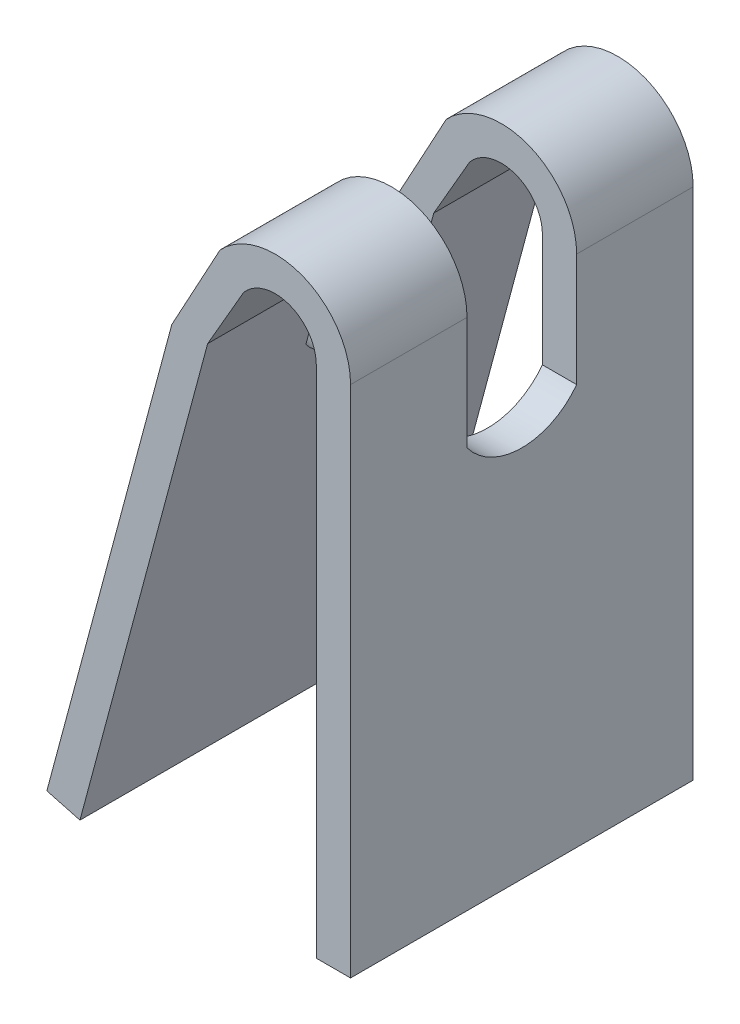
from build123d import *

# Parameters (mm, degrees)
BASE_EXTRUSION_DEPTH    = 50
ENL_V_MAT_EXTRU_1_DEPTH = 10
ENL_V_MAT_EXTRU_2_DEPTH = 15


with BuildPart() as part:
    # Esquisse1 → Base-Extrusion (new body)
    with BuildSketch(Plane.XY):
        with BuildLine():
            Line((0, 0), (5, 0))
            Line((5, 0), (5, 75))
            ThreePointArc((5, 75), (-1.966960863, 85.23399215), (-14.042653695, 82.504380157))
            Line((-14.042653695, 82.504380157), (-21.085427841, 69.558295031))
            Line((-21.085427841, 69.558295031), (-39.322352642, 1.497165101))
            Line((-39.322352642, 1.497165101), (-34.49272351, 0.203069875))
            Line((-34.49272351, 0.203069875), (-15.857752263, 69.749729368))
            Line((-15.857752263, 69.749729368), (-10.607752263, 78.842996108))
            ThreePointArc((-10.607752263, 78.842996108), (-3.956291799, 80.641210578), (0, 75))
            Line((0, 75), (0, 0))
        make_face()
    extrude(amount=BASE_EXTRUSION_DEPTH)

    # Esquisse2 → Enl_v. mat.-Extru.1 (cut)
    with BuildSketch(Plane(origin=(5, 0, 0), x_dir=(0, 0, -1), z_dir=(1, 0, 0))):
        with BuildLine():
            Line((-33, 90.023018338), (-17, 90.023018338))
            Line((-17, 90.023018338), (-17, 58.5))
            ThreePointArc((-17, 58.5), (-25, 54.5), (-33, 58.5))
            Line((-33, 58.5), (-33, 90.023018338))
        make_face()
    extrude(amount=-ENL_V_MAT_EXTRU_1_DEPTH, mode=Mode.SUBTRACT)

    # Esquisse3 → Enl_v. mat.-Extru.2 (cut)
    with BuildSketch(Plane(origin=(-37.062545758, 9.930879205, 0), x_dir=(0, 0, 1), z_dir=(-0.965925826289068, 0.25881904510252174, 0))):
        with BuildLine():
            Line((17, 86.233032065), (33, 86.233032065))
            Line((33, 86.233032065), (33, 53))
            ThreePointArc((33, 53), (25, 49), (17, 53))
            Line((17, 53), (17, 86.233032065))
        make_face()
    extrude(amount=-ENL_V_MAT_EXTRU_2_DEPTH, mode=Mode.SUBTRACT)


solid = part.part
